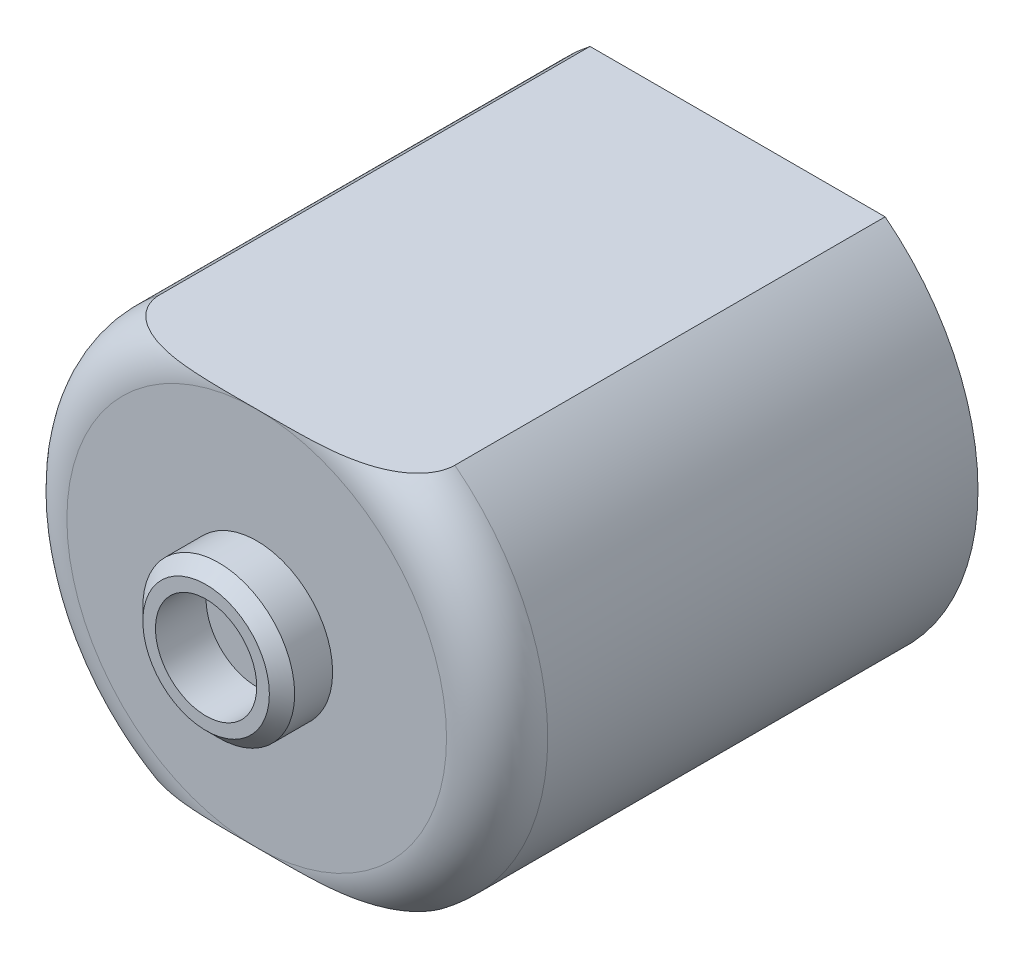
from build123d import *

# Parameters (mm, degrees)
ESQUISSE1_R             = 9.5
EXTRUSION1_DEPTH        = 19
CONG_1_R                = 2
ESQUISSE2_OUTSIDE_W     = 27.582
ESQUISSE2_OUTSIDE_H     = 27.582
ESQUISSE2_OUTSIDE_W_2   = 19
ESQUISSE2_OUTSIDE_H_2   = 15
ENL_V_MAT_EXTRU_1_DEPTH = 24.270152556
ESQUISSE3_R             = 3
ESQUISSE3_R_2           = 2
EXTRUSION2_DEPTH        = 2
CHANFREIN1_SIZE         = 0.5


with BuildPart() as part:
    # Esquisse1 → Extrusion1 (new body)
    with BuildSketch(Plane.XY):
        Circle(ESQUISSE1_R)
    extrude(amount=EXTRUSION1_DEPTH)

    # Cong_1
    cong_1_edges = [part.edges().sort_by_distance(p)[0] for p in [
        (-9.5, 0, 19),
    ]]
    fillet(cong_1_edges, radius=CONG_1_R)

    # Esquisse2 outside → Enl_v. mat.-Extru.1 (cut, through all)
    with BuildSketch(Plane.XY.offset(19)):
        Rectangle(ESQUISSE2_OUTSIDE_W, ESQUISSE2_OUTSIDE_H)
        Rectangle(ESQUISSE2_OUTSIDE_W_2, ESQUISSE2_OUTSIDE_H_2, mode=Mode.SUBTRACT)
    extrude(amount=-ENL_V_MAT_EXTRU_1_DEPTH, mode=Mode.SUBTRACT)

    # Esquisse3 → Extrusion2 (add)
    with BuildSketch(Plane.XY.offset(19)):
        Circle(ESQUISSE3_R)
        Circle(ESQUISSE3_R_2, mode=Mode.SUBTRACT)
    extrude(amount=EXTRUSION2_DEPTH)

    # Chanfrein1
    chanfrein1_edges = [part.edges().sort_by_distance(p)[0] for p in [
        (-3, 0, 21),
    ]]
    chamfer(chanfrein1_edges, length=CHANFREIN1_SIZE)


solid = part.part
